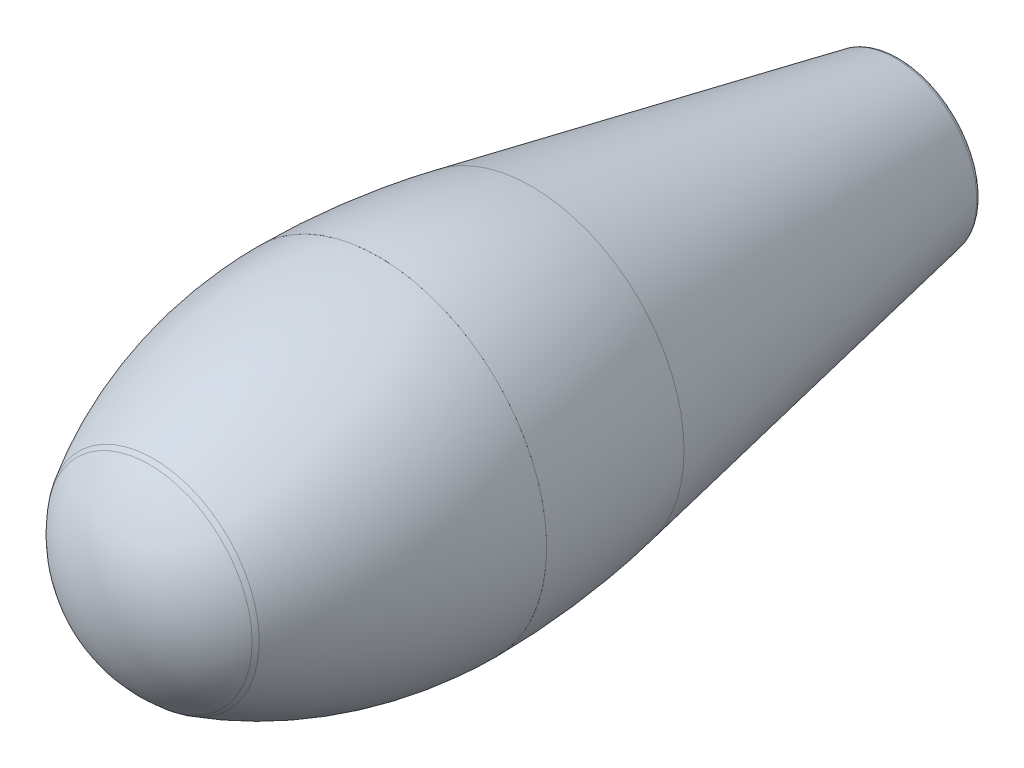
ISO-10303-21;
HEADER;
FILE_DESCRIPTION(('STEP AP214'),'2;1');
FILE_NAME('part.step','',(''),(''),'','','');
FILE_SCHEMA(('AUTOMOTIVE_DESIGN { 1 0 10303 214 1 1 1 1 }'));
ENDSEC;
DATA;
#1=APPLICATION_CONTEXT('core data for automotive mechanical design processes');
#2=APPLICATION_PROTOCOL_DEFINITION('international standard','automotive_design',2000,#1);
#3=PRODUCT_CONTEXT('',#1,'mechanical');
#4=PRODUCT('Part','Part','',(#3));
#5=PRODUCT_RELATED_PRODUCT_CATEGORY('part','',(#4));
#6=PRODUCT_DEFINITION_FORMATION('','',#4);
#7=PRODUCT_DEFINITION_CONTEXT('part definition',#1,'design');
#8=PRODUCT_DEFINITION('design','',#6,#7);
#9=PRODUCT_DEFINITION_SHAPE('','',#8);
#10=(LENGTH_UNIT() NAMED_UNIT(*) SI_UNIT(.MILLI.,.METRE.));
#11=(NAMED_UNIT(*) PLANE_ANGLE_UNIT() SI_UNIT($,.RADIAN.));
#12=(NAMED_UNIT(*) SI_UNIT($,.STERADIAN.) SOLID_ANGLE_UNIT());
#13=UNCERTAINTY_MEASURE_WITH_UNIT(LENGTH_MEASURE(1.E-05),#10,'distance_accuracy_value','');
#14=(GEOMETRIC_REPRESENTATION_CONTEXT(3) GLOBAL_UNCERTAINTY_ASSIGNED_CONTEXT((#13)) GLOBAL_UNIT_ASSIGNED_CONTEXT((#10,
#11,#12)) REPRESENTATION_CONTEXT('',''));
#15=CARTESIAN_POINT('',(0.,0.,0.));
#16=DIRECTION('',(0.,0.,1.));
#17=DIRECTION('',(1.,0.,0.));
#18=AXIS2_PLACEMENT_3D('',#15,#16,#17);
#19=CARTESIAN_POINT('',(0.,0.,60.9516000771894));
#20=DIRECTION('',(0.,0.,1.));
#21=DIRECTION('',(-1.,0.,0.));
#22=AXIS2_PLACEMENT_3D('',#19,#20,#21);
#23=DEGENERATE_TOROIDAL_SURFACE('',#22,4.10230149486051,6.13925077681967,.T.);
#24=CARTESIAN_POINT('',(0.,0.,64.8205185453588));
#25=DIRECTION('',(0.,0.,1.));
#26=DIRECTION('',(-1.,0.,0.));
#27=AXIS2_PLACEMENT_3D('',#24,#25,#26);
#28=CIRCLE('',#27,8.86904776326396);
#29=CARTESIAN_POINT('',(-8.86904776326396,0.,64.8205185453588));
#30=VERTEX_POINT('',#29);
#31=EDGE_CURVE('E8',#30,#30,#28,.T.);
#32=ORIENTED_EDGE('',*,*,#31,.F.);
#33=EDGE_LOOP('',(#32));
#34=FACE_BOUND('',#33,.T.);
#35=CARTESIAN_POINT('',(0.,0.,64.4722640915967));
#36=DIRECTION('',(0.,0.,1.));
#37=DIRECTION('',(-1.,0.,0.));
#38=AXIS2_PLACEMENT_3D('',#35,#36,#37);
#39=CIRCLE('',#38,9.13174728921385);
#40=CARTESIAN_POINT('',(-9.13174728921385,0.,64.4722640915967));
#41=VERTEX_POINT('',#40);
#42=EDGE_CURVE('E49',#41,#41,#39,.T.);
#43=ORIENTED_EDGE('',*,*,#42,.T.);
#44=EDGE_LOOP('',(#43));
#45=FACE_BOUND('',#44,.T.);
#46=ADVANCED_FACE('F12',(#34,#45),#23,.T.);
#47=CARTESIAN_POINT('',(0.,0.,57.5));
#48=DIRECTION('',(0.,0.,1.));
#49=DIRECTION('',(1.,0.,0.));
#50=AXIS2_PLACEMENT_3D('',#47,#48,#49);
#51=SPHERICAL_SURFACE('',#50,11.5);
#52=ORIENTED_EDGE('',*,*,#31,.T.);
#53=EDGE_LOOP('',(#52));
#54=FACE_BOUND('',#53,.T.);
#55=ADVANCED_FACE('F111',(#54),#51,.T.);
#56=CARTESIAN_POINT('',(5.,0.,45.));
#57=DIRECTION('',(0.,0.,1.));
#58=DIRECTION('',(-1.,0.,0.));
#59=AXIS2_PLACEMENT_3D('',#56,#57,#58);
#60=PLANE('',#59);
#61=CARTESIAN_POINT('',(0.,0.,45.));
#62=DIRECTION('',(0.,0.,1.));
#63=DIRECTION('',(-1.,0.,0.));
#64=AXIS2_PLACEMENT_3D('',#61,#62,#63);
#65=CIRCLE('',#64,5.);
#66=CARTESIAN_POINT('',(-5.,0.,45.));
#67=VERTEX_POINT('',#66);
#68=EDGE_CURVE('E18',#67,#67,#65,.T.);
#69=ORIENTED_EDGE('',*,*,#68,.F.);
#70=EDGE_LOOP('',(#69));
#71=FACE_BOUND('',#70,.T.);
#72=ADVANCED_FACE('F104',(#71),#60,.F.);
#73=CARTESIAN_POINT('',(0.,0.,69.));
#74=DIRECTION('',(0.,0.,1.));
#75=DIRECTION('',(-1.,0.,0.));
#76=AXIS2_PLACEMENT_3D('',#73,#74,#75);
#77=CYLINDRICAL_SURFACE('',#76,5.);
#78=CARTESIAN_POINT('',(0.,0.,15.));
#79=DIRECTION('',(0.,0.,1.));
#80=DIRECTION('',(-1.,0.,0.));
#81=AXIS2_PLACEMENT_3D('',#78,#79,#80);
#82=CIRCLE('',#81,5.);
#83=CARTESIAN_POINT('',(-5.,0.,15.));
#84=VERTEX_POINT('',#83);
#85=EDGE_CURVE('E22',#84,#84,#82,.T.);
#86=ORIENTED_EDGE('',*,*,#85,.F.);
#87=EDGE_LOOP('',(#86));
#88=FACE_BOUND('',#87,.T.);
#89=ORIENTED_EDGE('',*,*,#68,.T.);
#90=EDGE_LOOP('',(#89));
#91=FACE_BOUND('',#90,.T.);
#92=ADVANCED_FACE('F99',(#88,#91),#77,.F.);
#93=CARTESIAN_POINT('',(5.25,0.,15.));
#94=DIRECTION('',(0.,0.,1.));
#95=DIRECTION('',(-1.,0.,0.));
#96=AXIS2_PLACEMENT_3D('',#93,#94,#95);
#97=PLANE('',#96);
#98=CARTESIAN_POINT('',(0.,0.,15.));
#99=DIRECTION('',(0.,0.,1.));
#100=DIRECTION('',(-1.,0.,0.));
#101=AXIS2_PLACEMENT_3D('',#98,#99,#100);
#102=CIRCLE('',#101,5.25);
#103=CARTESIAN_POINT('',(-5.25,0.,15.));
#104=VERTEX_POINT('',#103);
#105=EDGE_CURVE('E26',#104,#104,#102,.T.);
#106=ORIENTED_EDGE('',*,*,#105,.F.);
#107=EDGE_LOOP('',(#106));
#108=FACE_BOUND('',#107,.T.);
#109=ORIENTED_EDGE('',*,*,#85,.T.);
#110=EDGE_LOOP('',(#109));
#111=FACE_BOUND('',#110,.T.);
#112=ADVANCED_FACE('F93',(#108,#111),#97,.F.);
#113=CARTESIAN_POINT('',(0.,0.,69.));
#114=DIRECTION('',(0.,0.,1.));
#115=DIRECTION('',(-1.,0.,0.));
#116=AXIS2_PLACEMENT_3D('',#113,#114,#115);
#117=CYLINDRICAL_SURFACE('',#116,5.25);
#118=CARTESIAN_POINT('',(0.,0.,0.));
#119=DIRECTION('',(0.,0.,1.));
#120=DIRECTION('',(-1.,0.,0.));
#121=AXIS2_PLACEMENT_3D('',#118,#119,#120);
#122=CIRCLE('',#121,5.25);
#123=CARTESIAN_POINT('',(-5.25,0.,0.));
#124=VERTEX_POINT('',#123);
#125=EDGE_CURVE('E31',#124,#124,#122,.T.);
#126=ORIENTED_EDGE('',*,*,#125,.F.);
#127=EDGE_LOOP('',(#126));
#128=FACE_BOUND('',#127,.T.);
#129=ORIENTED_EDGE('',*,*,#105,.T.);
#130=EDGE_LOOP('',(#129));
#131=FACE_BOUND('',#130,.T.);
#132=ADVANCED_FACE('F87',(#128,#131),#117,.F.);
#133=CARTESIAN_POINT('',(5.25,0.,0.));
#134=DIRECTION('',(0.,0.,1.));
#135=DIRECTION('',(-1.,0.,0.));
#136=AXIS2_PLACEMENT_3D('',#133,#134,#135);
#137=PLANE('',#136);
#138=CARTESIAN_POINT('',(0.,0.,0.));
#139=DIRECTION('',(0.,0.,1.));
#140=DIRECTION('',(-1.,0.,0.));
#141=AXIS2_PLACEMENT_3D('',#138,#139,#140);
#142=CIRCLE('',#141,6.58783180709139);
#143=CARTESIAN_POINT('',(-6.58783180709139,0.,0.));
#144=VERTEX_POINT('',#143);
#145=EDGE_CURVE('E34',#144,#144,#142,.T.);
#146=ORIENTED_EDGE('',*,*,#145,.F.);
#147=EDGE_LOOP('',(#146));
#148=FACE_BOUND('',#147,.T.);
#149=ORIENTED_EDGE('',*,*,#125,.T.);
#150=EDGE_LOOP('',(#149));
#151=FACE_BOUND('',#150,.T.);
#152=ADVANCED_FACE('F81',(#148,#151),#137,.F.);
#153=CARTESIAN_POINT('',(0.,0.,0.499999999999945));
#154=DIRECTION('',(0.,0.,1.));
#155=DIRECTION('',(-1.,0.,0.));
#156=AXIS2_PLACEMENT_3D('',#153,#154,#155);
#157=TOROIDAL_SURFACE('',#156,6.58783180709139,0.5);
#158=CARTESIAN_POINT('',(0.,0.,0.404595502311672));
#159=DIRECTION('',(0.,0.,1.));
#160=DIRECTION('',(-1.,0.,0.));
#161=AXIS2_PLACEMENT_3D('',#158,#159,#160);
#162=CIRCLE('',#161,7.07864539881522);
#163=CARTESIAN_POINT('',(-7.07864539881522,0.,0.404595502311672));
#164=VERTEX_POINT('',#163);
#165=EDGE_CURVE('E37',#164,#164,#162,.T.);
#166=ORIENTED_EDGE('',*,*,#165,.F.);
#167=EDGE_LOOP('',(#166));
#168=FACE_BOUND('',#167,.T.);
#169=ORIENTED_EDGE('',*,*,#145,.T.);
#170=EDGE_LOOP('',(#169));
#171=FACE_BOUND('',#170,.T.);
#172=ADVANCED_FACE('F75',(#168,#171),#157,.T.);
#173=CARTESIAN_POINT('',(0.,0.,0.404595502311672));
#174=DIRECTION('',(0.,0.,1.));
#175=DIRECTION('',(-1.,0.,0.));
#176=AXIS2_PLACEMENT_3D('',#173,#174,#175);
#177=CONICAL_SURFACE('',#176,7.07864539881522,0.191986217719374);
#178=CARTESIAN_POINT('',(0.,0.,31.8006950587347));
#179=DIRECTION('',(0.,0.,1.));
#180=DIRECTION('',(-1.,0.,0.));
#181=AXIS2_PLACEMENT_3D('',#178,#179,#180);
#182=CIRCLE('',#181,13.1814289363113);
#183=CARTESIAN_POINT('',(-13.1814289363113,0.,31.8006950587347));
#184=VERTEX_POINT('',#183);
#185=EDGE_CURVE('E40',#184,#184,#182,.T.);
#186=ORIENTED_EDGE('',*,*,#185,.F.);
#187=EDGE_LOOP('',(#186));
#188=FACE_BOUND('',#187,.T.);
#189=ORIENTED_EDGE('',*,*,#165,.T.);
#190=EDGE_LOOP('',(#189));
#191=FACE_BOUND('',#190,.T.);
#192=ADVANCED_FACE('F69',(#188,#191),#177,.T.);
#193=CARTESIAN_POINT('',(0.,0.,45.538942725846));
#194=DIRECTION('',(0.,0.,1.));
#195=DIRECTION('',(-1.,0.,0.));
#196=AXIS2_PLACEMENT_3D('',#193,#194,#195);
#197=DEGENERATE_TOROIDAL_SURFACE('',#196,57.4957282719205,72.,.F.);
#198=CARTESIAN_POINT('',(0.,0.,45.));
#199=DIRECTION('',(0.,0.,1.));
#200=DIRECTION('',(-1.,0.,0.));
#201=AXIS2_PLACEMENT_3D('',#198,#199,#200);
#202=CIRCLE('',#201,14.5022546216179);
#203=CARTESIAN_POINT('',(-14.5022546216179,0.,45.));
#204=VERTEX_POINT('',#203);
#205=EDGE_CURVE('E43',#204,#204,#202,.T.);
#206=ORIENTED_EDGE('',*,*,#205,.F.);
#207=EDGE_LOOP('',(#206));
#208=FACE_BOUND('',#207,.T.);
#209=ORIENTED_EDGE('',*,*,#185,.T.);
#210=EDGE_LOOP('',(#209));
#211=FACE_BOUND('',#210,.T.);
#212=ADVANCED_FACE('F63',(#208,#211),#197,.F.);
#213=CARTESIAN_POINT('',(14.5,0.,45.));
#214=DIRECTION('',(0.,0.,-1.));
#215=DIRECTION('',(1.,0.,0.));
#216=AXIS2_PLACEMENT_3D('',#213,#214,#215);
#217=PLANE('',#216);
#218=CARTESIAN_POINT('',(0.,0.,45.));
#219=DIRECTION('',(0.,0.,1.));
#220=DIRECTION('',(-1.,0.,0.));
#221=AXIS2_PLACEMENT_3D('',#218,#219,#220);
#222=CIRCLE('',#221,14.5);
#223=CARTESIAN_POINT('',(-14.5,0.,45.));
#224=VERTEX_POINT('',#223);
#225=EDGE_CURVE('E46',#224,#224,#222,.T.);
#226=ORIENTED_EDGE('',*,*,#225,.F.);
#227=EDGE_LOOP('',(#226));
#228=FACE_BOUND('',#227,.T.);
#229=ORIENTED_EDGE('',*,*,#205,.T.);
#230=EDGE_LOOP('',(#229));
#231=FACE_BOUND('',#230,.T.);
#232=ADVANCED_FACE('F57',(#228,#231),#217,.F.);
#233=CARTESIAN_POINT('',(0.,0.,45.));
#234=DIRECTION('',(0.,0.,1.));
#235=DIRECTION('',(-1.,0.,0.));
#236=AXIS2_PLACEMENT_3D('',#233,#234,#235);
#237=DEGENERATE_TOROIDAL_SURFACE('',#236,23.5,38.,.F.);
#238=ORIENTED_EDGE('',*,*,#42,.F.);
#239=EDGE_LOOP('',(#238));
#240=FACE_BOUND('',#239,.T.);
#241=ORIENTED_EDGE('',*,*,#225,.T.);
#242=EDGE_LOOP('',(#241));
#243=FACE_BOUND('',#242,.T.);
#244=ADVANCED_FACE('F54',(#240,#243),#237,.F.);
#245=CLOSED_SHELL('',(#46,#55,#72,#92,#112,#132,#152,#172,#192,#212,#232,#244));
#246=MANIFOLD_SOLID_BREP('B1',#245);
#247=ADVANCED_BREP_SHAPE_REPRESENTATION('',(#18,#246),#14);
#248=SHAPE_DEFINITION_REPRESENTATION(#9,#247);
ENDSEC;
END-ISO-10303-21;
